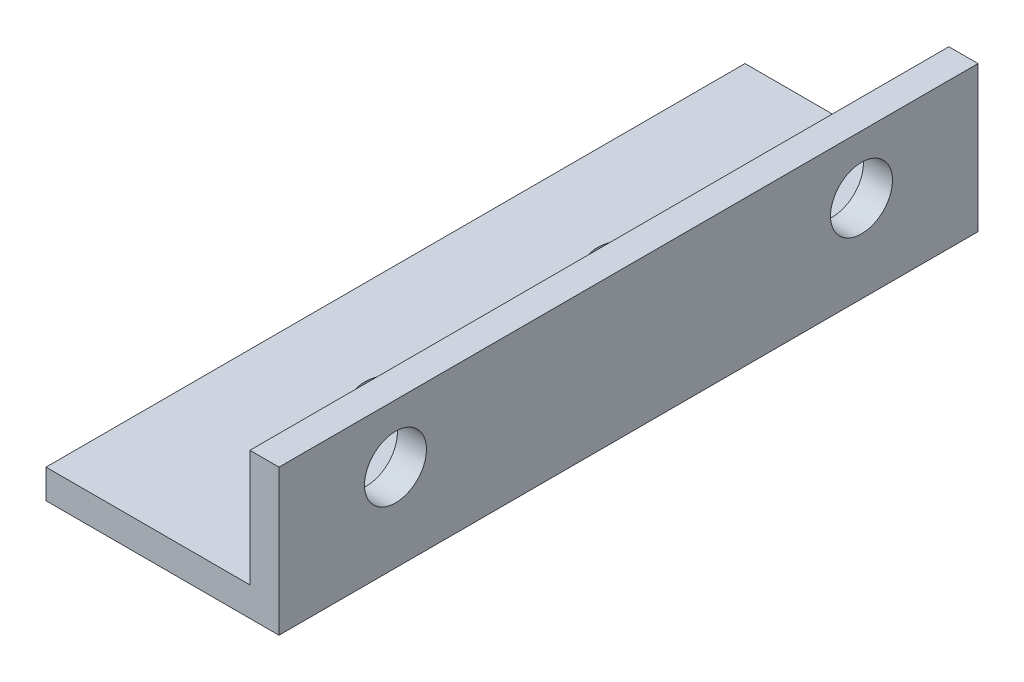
from build123d import *

# Parameters (mm, degrees)
BOSS_EXTRUDE1_DEPTH     = 76.2
F_1_4_CLEARANCE_HOLE1_D = 6.7564
F_1_4_CLEARANCE_HOLE2_D = 6.7564


with BuildPart() as part:
    # Sketch1 → Boss-Extrude1 (new body)
    with BuildSketch(Plane.XY):
        Polygon((0, 0), (0, 15.875), (-3.175, 15.875), (-3.175, 3.175), (-25.4, 3.175), (-25.4, 0), align=None)
    extrude(amount=-BOSS_EXTRUDE1_DEPTH)

    # 1_4 Clearance Hole1 (through all)
    with Locations(Plane(origin=(0, 3.175, 0), x_dir=(1, 0, 0), z_dir=(0, 1, 0))):
        with Locations((-12.7, 50.8), (-12.7, 25.4)):
            Hole(F_1_4_CLEARANCE_HOLE1_D / 2)

    # 1_4 Clearance Hole2 (through all)
    with Locations(Plane.ZY.offset(3.175)):
        with Locations((-63.5, 9.525), (-12.7, 9.525)):
            Hole(F_1_4_CLEARANCE_HOLE2_D / 2)


solid = part.part
